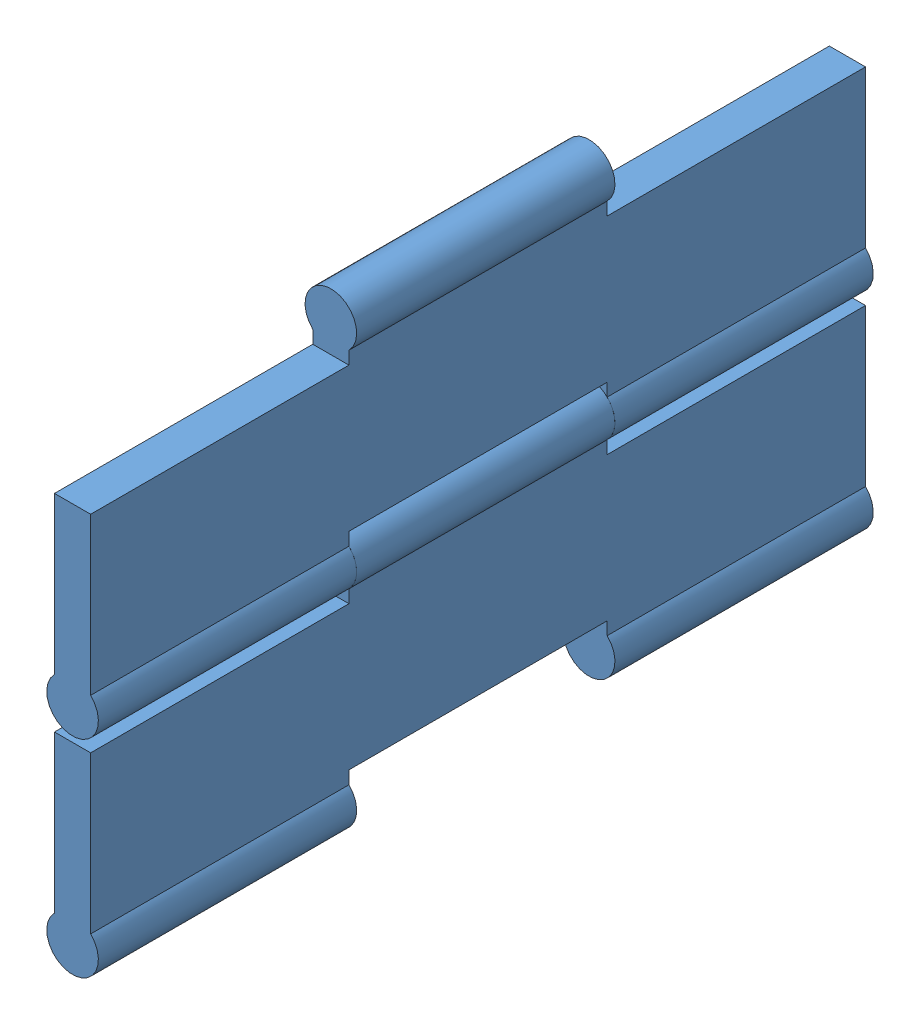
SolidWorks assembly Złożenie2.SLDASM, configuration Default (file format 4700). Lengths in mm.
Overall size (651.02 620 300).
2 component instances, 1 part files, 6 mates.
Components (placement in the parent):
- Element1-1: Element1.SLDPRT [Default] at (7 282.8383 0) x (-1 0 0) z (0 0 1) size (20 100 300)
- Element1-2: Element1.SLDPRT [Default] at (7 202.8383 0) x (-1 0 0) z (0 0 1) size (20 100 300)
Mates (geometry in assembly coordinates):
- Koncentryczne1: concentric aligned: cylinder of Element1-1 through (7 202.8383 300) axis (0 0 -1) radius 10; cylinder of Element1-2 through (7 202.8383 300) axis (0 0 -1) radius 10
- Wspólnie1: coincident aligned: plane of Element1-1 through (7 282.8383 300) normal (0 0 1); plane of Element1-2 through (7 202.8383 300) normal (0 0 1)
- Wspólnie2: coincident anti-aligned: plane of Element1-1 through (7 282.8383 0) normal (0 0 -1); plane of assembly through (0 0 0) normal (0 0 1)
- WiązanieŚcieżki1: path: point of Element1-1; curve of assembly; curve of assembly
- WiązanieŚcieżki2: path: point of Element1-2; curve of assembly; curve of assembly
- WiązanieŚcieżki3: path: point of Element1-2; curve of assembly; curve of assembly
